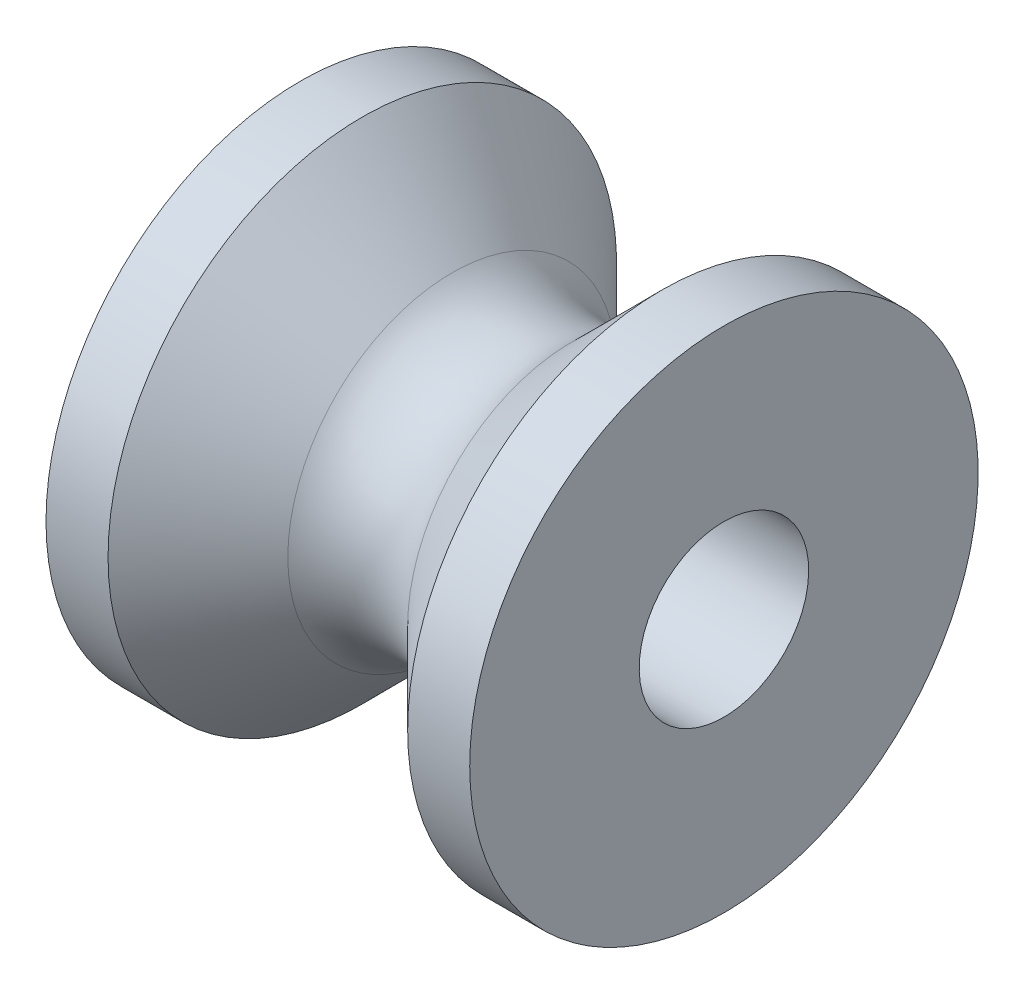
from build123d import *

# Parameters (mm, degrees)
SKETCH2_R          = 2
CUT_EXTRUDE3_DEPTH = 14.114877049
FILLET1_R          = 2


with BuildPart() as part:
    # Sketch1 → Revolve1 (revolve)
    with BuildSketch(Plane.XY, mode=Mode.PRIVATE) as revolve1_sk:
        Polygon((0, 2.464466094), (3.535533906, 6), (5, 6), (5, 0), (-5, 0), (-5, 6), (-3.535533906, 6), align=None)
    revolve(revolve1_sk.sketch.rotate(Axis((-5, 0, 0), (1, 0, 0)), 90), axis=Axis((-5, 0, 0), (1, 0, 0)))

    # Sketch2 → Cut-Extrude3 (cut, through all)
    with BuildSketch(Plane(origin=(5, 0, 0), x_dir=(0, 0, -1), z_dir=(1, 0, 0))):
        with Locations(Location((0, 0, 0), (0, 0, 90))):
            Circle(SKETCH2_R)
    extrude(amount=-CUT_EXTRUDE3_DEPTH, mode=Mode.SUBTRACT)

    # Fillet1
    fillet1_edges = [part.edges().sort_by_distance(p)[0] for p in [
        (0, 0, -2.464466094),
    ]]
    fillet(fillet1_edges, radius=FILLET1_R)


solid = part.part
